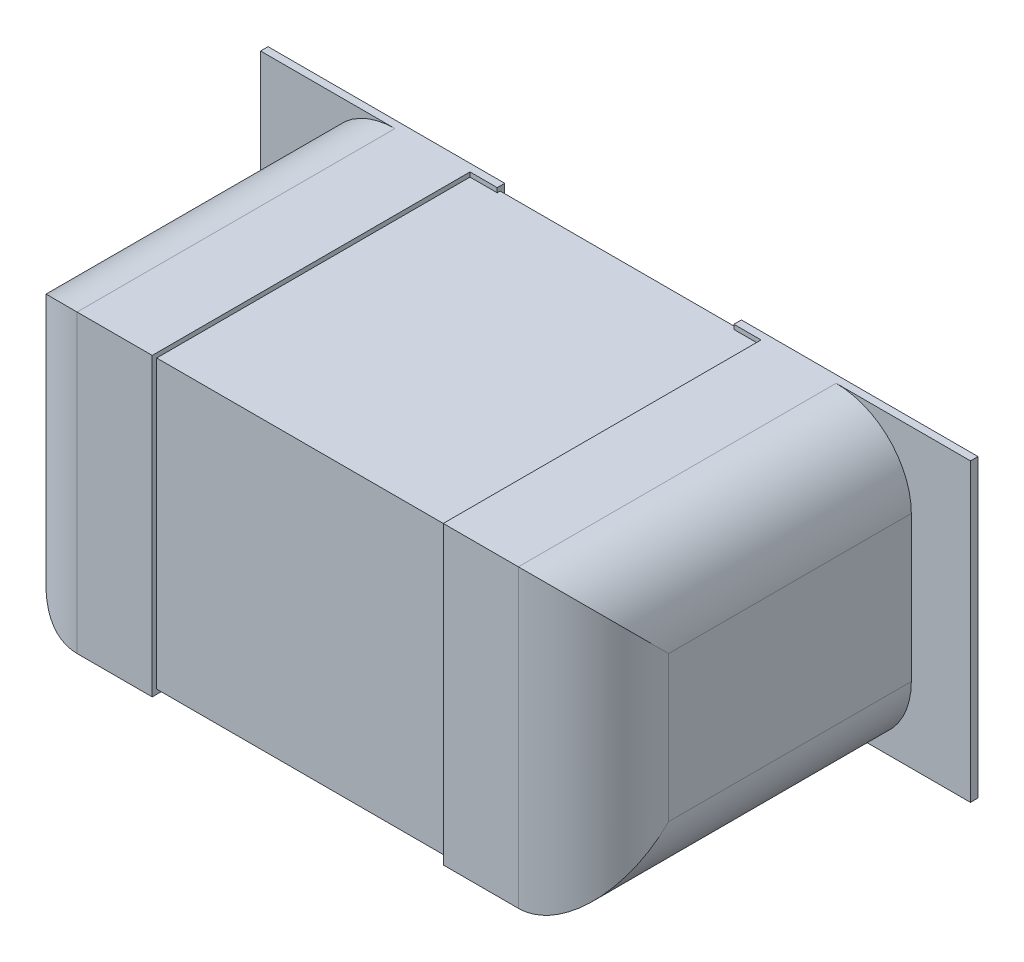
ISO-10303-21;
HEADER;
FILE_DESCRIPTION(('STEP AP214'),'2;1');
FILE_NAME('part.step','',(''),(''),'','','');
FILE_SCHEMA(('AUTOMOTIVE_DESIGN { 1 0 10303 214 1 1 1 1 }'));
ENDSEC;
DATA;
#1=APPLICATION_CONTEXT('core data for automotive mechanical design processes');
#2=APPLICATION_PROTOCOL_DEFINITION('international standard','automotive_design',2000,#1);
#3=PRODUCT_CONTEXT('',#1,'mechanical');
#4=PRODUCT('Part','Part','',(#3));
#5=PRODUCT_RELATED_PRODUCT_CATEGORY('part','',(#4));
#6=PRODUCT_DEFINITION_FORMATION('','',#4);
#7=PRODUCT_DEFINITION_CONTEXT('part definition',#1,'design');
#8=PRODUCT_DEFINITION('design','',#6,#7);
#9=PRODUCT_DEFINITION_SHAPE('','',#8);
#10=(LENGTH_UNIT() NAMED_UNIT(*) SI_UNIT(.MILLI.,.METRE.));
#11=(NAMED_UNIT(*) PLANE_ANGLE_UNIT() SI_UNIT($,.RADIAN.));
#12=(NAMED_UNIT(*) SI_UNIT($,.STERADIAN.) SOLID_ANGLE_UNIT());
#13=UNCERTAINTY_MEASURE_WITH_UNIT(LENGTH_MEASURE(1.E-05),#10,'distance_accuracy_value','');
#14=(GEOMETRIC_REPRESENTATION_CONTEXT(3) GLOBAL_UNCERTAINTY_ASSIGNED_CONTEXT((#13)) GLOBAL_UNIT_ASSIGNED_CONTEXT((#10,
#11,#12)) REPRESENTATION_CONTEXT('',''));
#15=CARTESIAN_POINT('',(0.,0.,0.));
#16=DIRECTION('',(0.,0.,1.));
#17=DIRECTION('',(1.,0.,0.));
#18=AXIS2_PLACEMENT_3D('',#15,#16,#17);
#19=CARTESIAN_POINT('',(0.500000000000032,-0.249999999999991,0.0762));
#20=DIRECTION('',(1.,0.,0.));
#21=DIRECTION('',(0.,0.,-1.));
#22=AXIS2_PLACEMENT_3D('',#19,#20,#21);
#23=PLANE('',#22);
#24=DIRECTION('',(0.,0.,-1.));
#25=VECTOR('',#24,1.);
#26=CARTESIAN_POINT('',(0.500000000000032,-0.122999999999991,0.62831867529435));
#27=LINE('',#26,#25);
#28=CARTESIAN_POINT('',(0.500000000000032,-0.122999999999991,0.0889));
#29=VERTEX_POINT('',#28);
#30=CARTESIAN_POINT('',(0.500000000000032,-0.122999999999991,0.49911));
#31=VERTEX_POINT('',#30);
#32=EDGE_CURVE('E324',#29,#31,#27,.F.);
#33=ORIENTED_EDGE('',*,*,#32,.F.);
#34=DIRECTION('',(0.,1.,0.));
#35=VECTOR('',#34,1.);
#36=CARTESIAN_POINT('',(0.500000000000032,0.,0.0889));
#37=LINE('',#36,#35);
#38=CARTESIAN_POINT('',(0.500000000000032,0.122999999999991,0.0889));
#39=VERTEX_POINT('',#38);
#40=EDGE_CURVE('E237',#39,#29,#37,.F.);
#41=ORIENTED_EDGE('',*,*,#40,.F.);
#42=DIRECTION('',(0.,0.,-1.));
#43=VECTOR('',#42,1.);
#44=CARTESIAN_POINT('',(0.500000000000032,0.122999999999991,0.62831867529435));
#45=LINE('',#44,#43);
#46=CARTESIAN_POINT('',(0.500000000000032,0.122999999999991,0.49911));
#47=VERTEX_POINT('',#46);
#48=EDGE_CURVE('E226',#47,#39,#45,.T.);
#49=ORIENTED_EDGE('',*,*,#48,.F.);
#50=DIRECTION('',(0.,1.,0.));
#51=VECTOR('',#50,1.);
#52=CARTESIAN_POINT('',(0.500000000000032,-0.252128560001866,0.49911));
#53=LINE('',#52,#51);
#54=EDGE_CURVE('E223',#31,#47,#53,.T.);
#55=ORIENTED_EDGE('',*,*,#54,.F.);
#56=EDGE_LOOP('',(#33,#41,#49,#55));
#57=FACE_BOUND('',#56,.T.);
#58=ADVANCED_FACE('F16',(#57),#23,.T.);
#59=CARTESIAN_POINT('',(-0.500000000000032,0.249999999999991,0.0762));
#60=DIRECTION('',(-1.,0.,0.));
#61=DIRECTION('',(0.,0.,1.));
#62=AXIS2_PLACEMENT_3D('',#59,#60,#61);
#63=PLANE('',#62);
#64=DIRECTION('',(0.,0.,-1.));
#65=VECTOR('',#64,1.);
#66=CARTESIAN_POINT('',(-0.500000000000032,0.122999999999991,0.62831867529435));
#67=LINE('',#66,#65);
#68=CARTESIAN_POINT('',(-0.500000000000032,0.122999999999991,0.0889));
#69=VERTEX_POINT('',#68);
#70=CARTESIAN_POINT('',(-0.500000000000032,0.122999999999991,0.49911));
#71=VERTEX_POINT('',#70);
#72=EDGE_CURVE('E308',#69,#71,#67,.F.);
#73=ORIENTED_EDGE('',*,*,#72,.F.);
#74=DIRECTION('',(0.,1.,0.));
#75=VECTOR('',#74,1.);
#76=CARTESIAN_POINT('',(-0.500000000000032,0.,0.0889));
#77=LINE('',#76,#75);
#78=CARTESIAN_POINT('',(-0.500000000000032,-0.122999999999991,0.0889));
#79=VERTEX_POINT('',#78);
#80=EDGE_CURVE('E312',#79,#69,#77,.T.);
#81=ORIENTED_EDGE('',*,*,#80,.F.);
#82=DIRECTION('',(0.,0.,-1.));
#83=VECTOR('',#82,1.);
#84=CARTESIAN_POINT('',(-0.500000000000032,-0.122999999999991,0.62831867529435));
#85=LINE('',#84,#83);
#86=CARTESIAN_POINT('',(-0.500000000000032,-0.122999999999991,0.49911));
#87=VERTEX_POINT('',#86);
#88=EDGE_CURVE('E315',#87,#79,#85,.T.);
#89=ORIENTED_EDGE('',*,*,#88,.F.);
#90=DIRECTION('',(0.,-1.,0.));
#91=VECTOR('',#90,1.);
#92=CARTESIAN_POINT('',(-0.500000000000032,0.252170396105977,0.49911));
#93=LINE('',#92,#91);
#94=EDGE_CURVE('E242',#71,#87,#93,.T.);
#95=ORIENTED_EDGE('',*,*,#94,.F.);
#96=EDGE_LOOP('',(#73,#81,#89,#95));
#97=FACE_BOUND('',#96,.T.);
#98=ADVANCED_FACE('F355',(#97),#63,.T.);
#99=CARTESIAN_POINT('',(-0.373000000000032,0.252170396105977,0.49911));
#100=DIRECTION('',(0.,-1.,0.));
#101=DIRECTION('',(0.,0.,-1.));
#102=AXIS2_PLACEMENT_3D('',#99,#100,#101);
#103=CYLINDRICAL_SURFACE('',#102,0.127);
#104=CARTESIAN_POINT('',(-0.373000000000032,-0.122999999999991,0.49911));
#105=DIRECTION('',(0.,-0.707106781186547,-0.707106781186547));
#106=DIRECTION('',(0.,0.707106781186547,-0.707106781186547));
#107=AXIS2_PLACEMENT_3D('',#104,#105,#106);
#108=ELLIPSE('',#107,0.179605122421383,0.127);
#109=CARTESIAN_POINT('',(-0.373000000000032,-0.249999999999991,0.62611));
#110=VERTEX_POINT('',#109);
#111=EDGE_CURVE('E316',#110,#87,#108,.T.);
#112=ORIENTED_EDGE('',*,*,#111,.F.);
#113=DIRECTION('',(0.,1.,0.));
#114=VECTOR('',#113,1.);
#115=CARTESIAN_POINT('',(-0.373000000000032,0.,0.62611));
#116=LINE('',#115,#114);
#117=CARTESIAN_POINT('',(-0.373000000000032,0.249999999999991,0.62611));
#118=VERTEX_POINT('',#117);
#119=EDGE_CURVE('E207',#118,#110,#116,.F.);
#120=ORIENTED_EDGE('',*,*,#119,.F.);
#121=CARTESIAN_POINT('',(-0.373000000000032,0.122999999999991,0.49911));
#122=DIRECTION('',(0.,0.707106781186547,-0.707106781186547));
#123=DIRECTION('',(0.,-0.707106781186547,-0.707106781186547));
#124=AXIS2_PLACEMENT_3D('',#121,#122,#123);
#125=ELLIPSE('',#124,0.179605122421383,0.127);
#126=EDGE_CURVE('E306',#71,#118,#125,.T.);
#127=ORIENTED_EDGE('',*,*,#126,.F.);
#128=ORIENTED_EDGE('',*,*,#94,.T.);
#129=EDGE_LOOP('',(#112,#120,#127,#128));
#130=FACE_BOUND('',#129,.T.);
#131=ADVANCED_FACE('F360',(#130),#103,.T.);
#132=CARTESIAN_POINT('',(0.373000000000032,-0.252128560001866,0.49911));
#133=DIRECTION('',(0.,1.,0.));
#134=DIRECTION('',(0.,0.,1.));
#135=AXIS2_PLACEMENT_3D('',#132,#133,#134);
#136=CYLINDRICAL_SURFACE('',#135,0.127);
#137=CARTESIAN_POINT('',(0.373000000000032,-0.122999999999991,0.49911));
#138=DIRECTION('',(0.,-0.707106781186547,-0.707106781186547));
#139=DIRECTION('',(0.,0.707106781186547,-0.707106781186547));
#140=AXIS2_PLACEMENT_3D('',#137,#138,#139);
#141=ELLIPSE('',#140,0.179605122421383,0.127);
#142=CARTESIAN_POINT('',(0.373000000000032,-0.249999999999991,0.62611));
#143=VERTEX_POINT('',#142);
#144=EDGE_CURVE('E322',#31,#143,#141,.T.);
#145=ORIENTED_EDGE('',*,*,#144,.F.);
#146=ORIENTED_EDGE('',*,*,#54,.T.);
#147=CARTESIAN_POINT('',(0.373000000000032,0.122999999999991,0.49911));
#148=DIRECTION('',(0.,0.707106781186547,-0.707106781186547));
#149=DIRECTION('',(0.,-0.707106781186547,-0.707106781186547));
#150=AXIS2_PLACEMENT_3D('',#147,#148,#149);
#151=ELLIPSE('',#150,0.179605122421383,0.127);
#152=CARTESIAN_POINT('',(0.373000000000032,0.249999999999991,0.62611));
#153=VERTEX_POINT('',#152);
#154=EDGE_CURVE('E19',#153,#47,#151,.T.);
#155=ORIENTED_EDGE('',*,*,#154,.F.);
#156=DIRECTION('',(0.,1.,0.));
#157=VECTOR('',#156,1.);
#158=CARTESIAN_POINT('',(0.373000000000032,0.,0.62611));
#159=LINE('',#158,#157);
#160=EDGE_CURVE('E197',#143,#153,#159,.T.);
#161=ORIENTED_EDGE('',*,*,#160,.F.);
#162=EDGE_LOOP('',(#145,#146,#155,#161));
#163=FACE_BOUND('',#162,.T.);
#164=ADVANCED_FACE('F221',(#163),#136,.T.);
#165=CARTESIAN_POINT('',(0.373000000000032,0.122999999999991,0.62831867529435));
#166=DIRECTION('',(0.,0.,-1.));
#167=DIRECTION('',(-1.,0.,0.));
#168=AXIS2_PLACEMENT_3D('',#165,#166,#167);
#169=CYLINDRICAL_SURFACE('',#168,0.127);
#170=ORIENTED_EDGE('',*,*,#48,.T.);
#171=CARTESIAN_POINT('',(0.373000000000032,0.122999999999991,0.0888999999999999));
#172=DIRECTION('',(0.,0.,-1.));
#173=DIRECTION('',(-1.,0.,0.));
#174=AXIS2_PLACEMENT_3D('',#171,#172,#173);
#175=CIRCLE('',#174,0.127);
#176=CARTESIAN_POINT('',(0.372860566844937,0.249999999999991,0.0889000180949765));
#177=VERTEX_POINT('',#176);
#178=EDGE_CURVE('E229',#177,#39,#175,.T.);
#179=ORIENTED_EDGE('',*,*,#178,.F.);
#180=DIRECTION('',(-0.000259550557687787,0.,-0.999999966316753));
#181=VECTOR('',#180,1.);
#182=CARTESIAN_POINT('',(0.373000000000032,0.249999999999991,0.62611));
#183=LINE('',#182,#181);
#184=EDGE_CURVE('E214',#153,#177,#183,.T.);
#185=ORIENTED_EDGE('',*,*,#184,.F.);
#186=ORIENTED_EDGE('',*,*,#154,.T.);
#187=EDGE_LOOP('',(#170,#179,#185,#186));
#188=FACE_BOUND('',#187,.T.);
#189=ADVANCED_FACE('F227',(#188),#169,.T.);
#190=CARTESIAN_POINT('',(0.5999988,-0.2500122,0.0762));
#191=DIRECTION('',(1.,0.,0.));
#192=DIRECTION('',(0.,0.,-1.));
#193=AXIS2_PLACEMENT_3D('',#190,#191,#192);
#194=PLANE('',#193);
#195=DIRECTION('',(0.,0.,-1.));
#196=VECTOR('',#195,1.);
#197=CARTESIAN_POINT('',(0.5999988,-0.249999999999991,0.0762));
#198=LINE('',#197,#196);
#199=CARTESIAN_POINT('',(0.5999988,-0.249999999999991,0.0762));
#200=VERTEX_POINT('',#199);
#201=CARTESIAN_POINT('',(0.5999988,-0.249999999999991,0.0889));
#202=VERTEX_POINT('',#201);
#203=EDGE_CURVE('E294',#200,#202,#198,.F.);
#204=ORIENTED_EDGE('',*,*,#203,.F.);
#205=DIRECTION('',(0.,1.,0.));
#206=VECTOR('',#205,1.);
#207=CARTESIAN_POINT('',(0.5999988,0.,0.0762));
#208=LINE('',#207,#206);
#209=CARTESIAN_POINT('',(0.5999988,0.249999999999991,0.0762));
#210=VERTEX_POINT('',#209);
#211=EDGE_CURVE('E297',#200,#210,#208,.T.);
#212=ORIENTED_EDGE('',*,*,#211,.T.);
#213=DIRECTION('',(0.,0.,1.));
#214=VECTOR('',#213,1.);
#215=CARTESIAN_POINT('',(0.5999988,0.249999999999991,0.0762));
#216=LINE('',#215,#214);
#217=CARTESIAN_POINT('',(0.5999988,0.249999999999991,0.0889));
#218=VERTEX_POINT('',#217);
#219=EDGE_CURVE('E233',#218,#210,#216,.F.);
#220=ORIENTED_EDGE('',*,*,#219,.F.);
#221=DIRECTION('',(0.,1.,0.));
#222=VECTOR('',#221,1.);
#223=CARTESIAN_POINT('',(0.5999988,0.,0.0889));
#224=LINE('',#223,#222);
#225=EDGE_CURVE('E240',#202,#218,#224,.T.);
#226=ORIENTED_EDGE('',*,*,#225,.F.);
#227=EDGE_LOOP('',(#204,#212,#220,#226));
#228=FACE_BOUND('',#227,.T.);
#229=ADVANCED_FACE('F335',(#228),#194,.T.);
#230=CARTESIAN_POINT('',(0.,0.,0.0889));
#231=DIRECTION('',(0.,0.,1.));
#232=DIRECTION('',(1.,0.,0.));
#233=AXIS2_PLACEMENT_3D('',#230,#231,#232);
#234=PLANE('',#233);
#235=ORIENTED_EDGE('',*,*,#178,.T.);
#236=ORIENTED_EDGE('',*,*,#40,.T.);
#237=CARTESIAN_POINT('',(0.373000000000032,-0.122999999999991,0.0888999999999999));
#238=DIRECTION('',(0.,0.,-1.));
#239=DIRECTION('',(-1.,0.,0.));
#240=AXIS2_PLACEMENT_3D('',#237,#238,#239);
#241=CIRCLE('',#240,0.127);
#242=CARTESIAN_POINT('',(0.372860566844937,-0.249999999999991,0.0889000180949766));
#243=VERTEX_POINT('',#242);
#244=EDGE_CURVE('E319',#243,#29,#241,.F.);
#245=ORIENTED_EDGE('',*,*,#244,.F.);
#246=DIRECTION('',(1.,0.,0.));
#247=VECTOR('',#246,1.);
#248=CARTESIAN_POINT('',(-0.500000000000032,-0.249999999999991,0.0889));
#249=LINE('',#248,#247);
#250=EDGE_CURVE('E296',#202,#243,#249,.F.);
#251=ORIENTED_EDGE('',*,*,#250,.F.);
#252=ORIENTED_EDGE('',*,*,#225,.T.);
#253=DIRECTION('',(1.,0.,0.));
#254=VECTOR('',#253,1.);
#255=CARTESIAN_POINT('',(0.500000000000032,0.249999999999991,0.0889));
#256=LINE('',#255,#254);
#257=EDGE_CURVE('E231',#177,#218,#256,.T.);
#258=ORIENTED_EDGE('',*,*,#257,.F.);
#259=EDGE_LOOP('',(#235,#236,#245,#251,#252,#258));
#260=FACE_BOUND('',#259,.T.);
#261=ADVANCED_FACE('F328',(#260),#234,.T.);
#262=CARTESIAN_POINT('',(0.373000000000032,-0.122999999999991,0.62831867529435));
#263=DIRECTION('',(0.,0.,-1.));
#264=DIRECTION('',(-1.,0.,0.));
#265=AXIS2_PLACEMENT_3D('',#262,#263,#264);
#266=CYLINDRICAL_SURFACE('',#265,0.127);
#267=DIRECTION('',(0.000259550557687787,0.,0.999999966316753));
#268=VECTOR('',#267,1.);
#269=CARTESIAN_POINT('',(0.37286056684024,-0.249999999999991,0.0889));
#270=LINE('',#269,#268);
#271=EDGE_CURVE('E342',#243,#143,#270,.T.);
#272=ORIENTED_EDGE('',*,*,#271,.F.);
#273=ORIENTED_EDGE('',*,*,#244,.T.);
#274=ORIENTED_EDGE('',*,*,#32,.T.);
#275=ORIENTED_EDGE('',*,*,#144,.T.);
#276=EDGE_LOOP('',(#272,#273,#274,#275));
#277=FACE_BOUND('',#276,.T.);
#278=ADVANCED_FACE('F352',(#277),#266,.T.);
#279=CARTESIAN_POINT('',(-0.373000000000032,-0.122999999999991,0.62831867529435));
#280=DIRECTION('',(0.,0.,-1.));
#281=DIRECTION('',(-1.,0.,0.));
#282=AXIS2_PLACEMENT_3D('',#279,#280,#281);
#283=CYLINDRICAL_SURFACE('',#282,0.127);
#284=ORIENTED_EDGE('',*,*,#88,.T.);
#285=CARTESIAN_POINT('',(-0.373000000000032,-0.122999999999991,0.0888999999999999));
#286=DIRECTION('',(0.,0.,-1.));
#287=DIRECTION('',(-1.,0.,0.));
#288=AXIS2_PLACEMENT_3D('',#285,#286,#287);
#289=CIRCLE('',#288,0.127);
#290=CARTESIAN_POINT('',(-0.372860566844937,-0.249999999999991,0.0889000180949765));
#291=VERTEX_POINT('',#290);
#292=EDGE_CURVE('E309',#291,#79,#289,.T.);
#293=ORIENTED_EDGE('',*,*,#292,.F.);
#294=DIRECTION('',(0.000259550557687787,0.,-0.999999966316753));
#295=VECTOR('',#294,1.);
#296=CARTESIAN_POINT('',(-0.373000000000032,-0.249999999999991,0.62611));
#297=LINE('',#296,#295);
#298=EDGE_CURVE('E289',#110,#291,#297,.T.);
#299=ORIENTED_EDGE('',*,*,#298,.F.);
#300=ORIENTED_EDGE('',*,*,#111,.T.);
#301=EDGE_LOOP('',(#284,#293,#299,#300));
#302=FACE_BOUND('',#301,.T.);
#303=ADVANCED_FACE('F449',(#302),#283,.T.);
#304=CARTESIAN_POINT('',(-0.5999988,0.2500122,0.0762));
#305=DIRECTION('',(-1.,0.,0.));
#306=DIRECTION('',(0.,0.,1.));
#307=AXIS2_PLACEMENT_3D('',#304,#305,#306);
#308=PLANE('',#307);
#309=DIRECTION('',(0.,0.,1.));
#310=VECTOR('',#309,1.);
#311=CARTESIAN_POINT('',(-0.5999988,0.249999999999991,0.0762));
#312=LINE('',#311,#310);
#313=CARTESIAN_POINT('',(-0.5999988,0.249999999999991,0.0762));
#314=VERTEX_POINT('',#313);
#315=CARTESIAN_POINT('',(-0.5999988,0.249999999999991,0.0889));
#316=VERTEX_POINT('',#315);
#317=EDGE_CURVE('E277',#314,#316,#312,.T.);
#318=ORIENTED_EDGE('',*,*,#317,.F.);
#319=DIRECTION('',(0.,1.,0.));
#320=VECTOR('',#319,1.);
#321=CARTESIAN_POINT('',(-0.5999988,0.,0.0762));
#322=LINE('',#321,#320);
#323=CARTESIAN_POINT('',(-0.5999988,-0.249999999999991,0.0762));
#324=VERTEX_POINT('',#323);
#325=EDGE_CURVE('E280',#314,#324,#322,.F.);
#326=ORIENTED_EDGE('',*,*,#325,.T.);
#327=DIRECTION('',(0.,0.,-1.));
#328=VECTOR('',#327,1.);
#329=CARTESIAN_POINT('',(-0.5999988,-0.249999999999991,0.0762));
#330=LINE('',#329,#328);
#331=CARTESIAN_POINT('',(-0.5999988,-0.249999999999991,0.0889));
#332=VERTEX_POINT('',#331);
#333=EDGE_CURVE('E284',#332,#324,#330,.T.);
#334=ORIENTED_EDGE('',*,*,#333,.F.);
#335=DIRECTION('',(0.,1.,0.));
#336=VECTOR('',#335,1.);
#337=CARTESIAN_POINT('',(-0.5999988,0.,0.0889));
#338=LINE('',#337,#336);
#339=EDGE_CURVE('E313',#316,#332,#338,.F.);
#340=ORIENTED_EDGE('',*,*,#339,.F.);
#341=EDGE_LOOP('',(#318,#326,#334,#340));
#342=FACE_BOUND('',#341,.T.);
#343=ADVANCED_FACE('F445',(#342),#308,.T.);
#344=CARTESIAN_POINT('',(0.,0.,0.0889));
#345=DIRECTION('',(0.,0.,1.));
#346=DIRECTION('',(1.,0.,0.));
#347=AXIS2_PLACEMENT_3D('',#344,#345,#346);
#348=PLANE('',#347);
#349=ORIENTED_EDGE('',*,*,#292,.T.);
#350=ORIENTED_EDGE('',*,*,#80,.T.);
#351=CARTESIAN_POINT('',(-0.373000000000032,0.122999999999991,0.0888999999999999));
#352=DIRECTION('',(0.,0.,-1.));
#353=DIRECTION('',(-1.,0.,0.));
#354=AXIS2_PLACEMENT_3D('',#351,#352,#353);
#355=CIRCLE('',#354,0.127);
#356=CARTESIAN_POINT('',(-0.372860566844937,0.249999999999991,0.0889000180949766));
#357=VERTEX_POINT('',#356);
#358=EDGE_CURVE('E303',#357,#69,#355,.F.);
#359=ORIENTED_EDGE('',*,*,#358,.F.);
#360=DIRECTION('',(1.,0.,0.));
#361=VECTOR('',#360,1.);
#362=CARTESIAN_POINT('',(0.500000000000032,0.249999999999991,0.0889));
#363=LINE('',#362,#361);
#364=EDGE_CURVE('E279',#316,#357,#363,.T.);
#365=ORIENTED_EDGE('',*,*,#364,.F.);
#366=ORIENTED_EDGE('',*,*,#339,.T.);
#367=DIRECTION('',(1.,0.,0.));
#368=VECTOR('',#367,1.);
#369=CARTESIAN_POINT('',(-0.500000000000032,-0.249999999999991,0.0889));
#370=LINE('',#369,#368);
#371=EDGE_CURVE('E286',#291,#332,#370,.F.);
#372=ORIENTED_EDGE('',*,*,#371,.F.);
#373=EDGE_LOOP('',(#349,#350,#359,#365,#366,#372));
#374=FACE_BOUND('',#373,.T.);
#375=ADVANCED_FACE('F441',(#374),#348,.T.);
#376=CARTESIAN_POINT('',(-0.373000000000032,0.122999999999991,0.62831867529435));
#377=DIRECTION('',(0.,0.,-1.));
#378=DIRECTION('',(-1.,0.,0.));
#379=AXIS2_PLACEMENT_3D('',#376,#377,#378);
#380=CYLINDRICAL_SURFACE('',#379,0.127);
#381=DIRECTION('',(-0.000259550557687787,0.,0.999999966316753));
#382=VECTOR('',#381,1.);
#383=CARTESIAN_POINT('',(-0.37286056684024,0.249999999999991,0.0889));
#384=LINE('',#383,#382);
#385=EDGE_CURVE('E482',#357,#118,#384,.T.);
#386=ORIENTED_EDGE('',*,*,#385,.F.);
#387=ORIENTED_EDGE('',*,*,#358,.T.);
#388=ORIENTED_EDGE('',*,*,#72,.T.);
#389=ORIENTED_EDGE('',*,*,#126,.T.);
#390=EDGE_LOOP('',(#386,#387,#388,#389));
#391=FACE_BOUND('',#390,.T.);
#392=ADVANCED_FACE('F437',(#391),#380,.T.);
#393=CARTESIAN_POINT('',(0.,0.,0.62611));
#394=DIRECTION('',(0.,0.,1.));
#395=DIRECTION('',(1.,0.,0.));
#396=AXIS2_PLACEMENT_3D('',#393,#394,#395);
#397=PLANE('',#396);
#398=DIRECTION('',(1.,0.,0.));
#399=VECTOR('',#398,1.);
#400=CARTESIAN_POINT('',(0.500000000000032,0.249999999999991,0.62611));
#401=LINE('',#400,#399);
#402=CARTESIAN_POINT('',(-0.246000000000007,0.249999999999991,0.62611));
#403=VERTEX_POINT('',#402);
#404=EDGE_CURVE('E276',#118,#403,#401,.T.);
#405=ORIENTED_EDGE('',*,*,#404,.F.);
#406=ORIENTED_EDGE('',*,*,#119,.T.);
#407=DIRECTION('',(1.,0.,0.));
#408=VECTOR('',#407,1.);
#409=CARTESIAN_POINT('',(-0.500000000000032,-0.249999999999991,0.62611));
#410=LINE('',#409,#408);
#411=CARTESIAN_POINT('',(-0.246000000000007,-0.250002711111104,0.62611));
#412=VERTEX_POINT('',#411);
#413=EDGE_CURVE('E293',#412,#110,#410,.F.);
#414=ORIENTED_EDGE('',*,*,#413,.F.);
#415=DIRECTION('',(0.,1.,0.));
#416=VECTOR('',#415,1.);
#417=CARTESIAN_POINT('',(-0.246000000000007,-0.249999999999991,0.62611));
#418=LINE('',#417,#416);
#419=EDGE_CURVE('E513',#412,#403,#418,.T.);
#420=ORIENTED_EDGE('',*,*,#419,.T.);
#421=EDGE_LOOP('',(#405,#406,#414,#420));
#422=FACE_BOUND('',#421,.T.);
#423=ADVANCED_FACE('F434',(#422),#397,.T.);
#424=CARTESIAN_POINT('',(0.,0.,0.62611));
#425=DIRECTION('',(0.,0.,1.));
#426=DIRECTION('',(1.,0.,0.));
#427=AXIS2_PLACEMENT_3D('',#424,#425,#426);
#428=PLANE('',#427);
#429=DIRECTION('',(1.,0.,0.));
#430=VECTOR('',#429,1.);
#431=CARTESIAN_POINT('',(-0.500000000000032,-0.249999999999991,0.62611));
#432=LINE('',#431,#430);
#433=CARTESIAN_POINT('',(0.246000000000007,-0.249999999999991,0.62611));
#434=VERTEX_POINT('',#433);
#435=EDGE_CURVE('E203',#143,#434,#432,.F.);
#436=ORIENTED_EDGE('',*,*,#435,.F.);
#437=ORIENTED_EDGE('',*,*,#160,.T.);
#438=DIRECTION('',(1.,0.,0.));
#439=VECTOR('',#438,1.);
#440=CARTESIAN_POINT('',(0.500000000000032,0.249999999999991,0.62611));
#441=LINE('',#440,#439);
#442=CARTESIAN_POINT('',(0.246000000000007,0.250002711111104,0.62611));
#443=VERTEX_POINT('',#442);
#444=EDGE_CURVE('E201',#443,#153,#441,.T.);
#445=ORIENTED_EDGE('',*,*,#444,.F.);
#446=DIRECTION('',(0.,1.,0.));
#447=VECTOR('',#446,1.);
#448=CARTESIAN_POINT('',(0.246000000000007,-0.249999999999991,0.62611));
#449=LINE('',#448,#447);
#450=EDGE_CURVE('E568',#443,#434,#449,.F.);
#451=ORIENTED_EDGE('',*,*,#450,.T.);
#452=EDGE_LOOP('',(#436,#437,#445,#451));
#453=FACE_BOUND('',#452,.T.);
#454=ADVANCED_FACE('F199',(#453),#428,.T.);
#455=CARTESIAN_POINT('',(0.,0.,0.0889));
#456=DIRECTION('',(0.,0.,1.));
#457=DIRECTION('',(1.,0.,0.));
#458=AXIS2_PLACEMENT_3D('',#455,#456,#457);
#459=PLANE('',#458);
#460=DIRECTION('',(1.,0.,0.));
#461=VECTOR('',#460,1.);
#462=CARTESIAN_POINT('',(-0.246000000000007,0.242379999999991,0.0889));
#463=LINE('',#462,#461);
#464=CARTESIAN_POINT('',(0.1999996,0.242379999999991,0.0889));
#465=VERTEX_POINT('',#464);
#466=CARTESIAN_POINT('',(0.246000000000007,0.242379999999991,0.0889));
#467=VERTEX_POINT('',#466);
#468=EDGE_CURVE('E529',#465,#467,#463,.T.);
#469=ORIENTED_EDGE('',*,*,#468,.T.);
#470=DIRECTION('',(0.,1.,0.));
#471=VECTOR('',#470,1.);
#472=CARTESIAN_POINT('',(0.246000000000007,-0.249999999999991,0.0889));
#473=LINE('',#472,#471);
#474=CARTESIAN_POINT('',(0.246000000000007,0.250002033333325,0.0889));
#475=VERTEX_POINT('',#474);
#476=EDGE_CURVE('E558',#467,#475,#473,.T.);
#477=ORIENTED_EDGE('',*,*,#476,.T.);
#478=DIRECTION('',(1.,0.,0.));
#479=VECTOR('',#478,1.);
#480=CARTESIAN_POINT('',(0.500000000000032,0.249999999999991,0.0889));
#481=LINE('',#480,#479);
#482=CARTESIAN_POINT('',(0.1999996,0.249999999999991,0.0889));
#483=VERTEX_POINT('',#482);
#484=EDGE_CURVE('E301',#483,#475,#481,.T.);
#485=ORIENTED_EDGE('',*,*,#484,.F.);
#486=DIRECTION('',(0.,1.,0.));
#487=VECTOR('',#486,1.);
#488=CARTESIAN_POINT('',(0.1999996,0.2500122,0.0889));
#489=LINE('',#488,#487);
#490=EDGE_CURVE('E257',#465,#483,#489,.T.);
#491=ORIENTED_EDGE('',*,*,#490,.F.);
#492=EDGE_LOOP('',(#469,#477,#485,#491));
#493=FACE_BOUND('',#492,.T.);
#494=ADVANCED_FACE('F428',(#493),#459,.T.);
#495=CARTESIAN_POINT('',(0.500000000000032,0.249999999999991,0.0762));
#496=DIRECTION('',(0.,1.,0.));
#497=DIRECTION('',(0.,0.,1.));
#498=AXIS2_PLACEMENT_3D('',#495,#496,#497);
#499=PLANE('',#498);
#500=ORIENTED_EDGE('',*,*,#484,.T.);
#501=DIRECTION('',(0.,0.,-1.));
#502=VECTOR('',#501,1.);
#503=CARTESIAN_POINT('',(0.246000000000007,0.25000406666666,0.08382));
#504=LINE('',#503,#502);
#505=EDGE_CURVE('E217',#475,#443,#504,.F.);
#506=ORIENTED_EDGE('',*,*,#505,.T.);
#507=ORIENTED_EDGE('',*,*,#444,.T.);
#508=ORIENTED_EDGE('',*,*,#184,.T.);
#509=ORIENTED_EDGE('',*,*,#257,.T.);
#510=ORIENTED_EDGE('',*,*,#219,.T.);
#511=DIRECTION('',(1.,0.,0.));
#512=VECTOR('',#511,1.);
#513=CARTESIAN_POINT('',(0.500000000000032,0.249999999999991,0.0762));
#514=LINE('',#513,#512);
#515=CARTESIAN_POINT('',(0.1999996,0.249999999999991,0.0762));
#516=VERTEX_POINT('',#515);
#517=EDGE_CURVE('E298',#210,#516,#514,.F.);
#518=ORIENTED_EDGE('',*,*,#517,.T.);
#519=DIRECTION('',(0.,0.,-1.));
#520=VECTOR('',#519,1.);
#521=CARTESIAN_POINT('',(0.1999996,0.249999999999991,0.0762));
#522=LINE('',#521,#520);
#523=EDGE_CURVE('E255',#483,#516,#522,.T.);
#524=ORIENTED_EDGE('',*,*,#523,.F.);
#525=EDGE_LOOP('',(#500,#506,#507,#508,#509,#510,#518,#524));
#526=FACE_BOUND('',#525,.T.);
#527=ADVANCED_FACE('F211',(#526),#499,.T.);
#528=CARTESIAN_POINT('',(0.,0.,0.0762));
#529=DIRECTION('',(0.,0.,1.));
#530=DIRECTION('',(1.,0.,0.));
#531=AXIS2_PLACEMENT_3D('',#528,#529,#530);
#532=PLANE('',#531);
#533=DIRECTION('',(1.,0.,0.));
#534=VECTOR('',#533,1.);
#535=CARTESIAN_POINT('',(-0.500000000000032,-0.249999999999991,0.0762));
#536=LINE('',#535,#534);
#537=CARTESIAN_POINT('',(0.1999996,-0.249999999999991,0.0762));
#538=VERTEX_POINT('',#537);
#539=EDGE_CURVE('E290',#538,#200,#536,.T.);
#540=ORIENTED_EDGE('',*,*,#539,.F.);
#541=DIRECTION('',(0.,1.,0.));
#542=VECTOR('',#541,1.);
#543=CARTESIAN_POINT('',(0.1999996,0.2500122,0.0762));
#544=LINE('',#543,#542);
#545=EDGE_CURVE('E254',#516,#538,#544,.F.);
#546=ORIENTED_EDGE('',*,*,#545,.F.);
#547=ORIENTED_EDGE('',*,*,#517,.F.);
#548=ORIENTED_EDGE('',*,*,#211,.F.);
#549=EDGE_LOOP('',(#540,#546,#547,#548));
#550=FACE_BOUND('',#549,.T.);
#551=ADVANCED_FACE('F423',(#550),#532,.F.);
#552=CARTESIAN_POINT('',(-0.500000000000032,-0.249999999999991,0.0762));
#553=DIRECTION('',(0.,-1.,0.));
#554=DIRECTION('',(0.,0.,-1.));
#555=AXIS2_PLACEMENT_3D('',#552,#553,#554);
#556=PLANE('',#555);
#557=DIRECTION('',(0.,0.,1.));
#558=VECTOR('',#557,1.);
#559=CARTESIAN_POINT('',(0.1999996,-0.249999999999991,0.0762));
#560=LINE('',#559,#558);
#561=CARTESIAN_POINT('',(0.1999996,-0.249999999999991,0.0889));
#562=VERTEX_POINT('',#561);
#563=EDGE_CURVE('E251',#538,#562,#560,.T.);
#564=ORIENTED_EDGE('',*,*,#563,.F.);
#565=ORIENTED_EDGE('',*,*,#539,.T.);
#566=ORIENTED_EDGE('',*,*,#203,.T.);
#567=ORIENTED_EDGE('',*,*,#250,.T.);
#568=ORIENTED_EDGE('',*,*,#271,.T.);
#569=ORIENTED_EDGE('',*,*,#435,.T.);
#570=DIRECTION('',(0.,0.,-1.));
#571=VECTOR('',#570,1.);
#572=CARTESIAN_POINT('',(0.246000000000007,-0.249999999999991,0.08382));
#573=LINE('',#572,#571);
#574=CARTESIAN_POINT('',(0.246000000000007,-0.249999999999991,0.0889));
#575=VERTEX_POINT('',#574);
#576=EDGE_CURVE('E264',#434,#575,#573,.T.);
#577=ORIENTED_EDGE('',*,*,#576,.T.);
#578=DIRECTION('',(1.,0.,0.));
#579=VECTOR('',#578,1.);
#580=CARTESIAN_POINT('',(0.,-0.249999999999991,0.0889));
#581=LINE('',#580,#579);
#582=EDGE_CURVE('E258',#562,#575,#581,.T.);
#583=ORIENTED_EDGE('',*,*,#582,.F.);
#584=EDGE_LOOP('',(#564,#565,#566,#567,#568,#569,#577,#583));
#585=FACE_BOUND('',#584,.T.);
#586=ADVANCED_FACE('F347',(#585),#556,.T.);
#587=CARTESIAN_POINT('',(-0.500000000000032,-0.249999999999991,0.0762));
#588=DIRECTION('',(0.,-1.,0.));
#589=DIRECTION('',(0.,0.,-1.));
#590=AXIS2_PLACEMENT_3D('',#587,#588,#589);
#591=PLANE('',#590);
#592=DIRECTION('',(1.,0.,0.));
#593=VECTOR('',#592,1.);
#594=CARTESIAN_POINT('',(0.,-0.25000406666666,0.0889));
#595=LINE('',#594,#593);
#596=CARTESIAN_POINT('',(-0.246000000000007,-0.250003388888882,0.0889));
#597=VERTEX_POINT('',#596);
#598=CARTESIAN_POINT('',(-0.1999996,-0.250002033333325,0.0889));
#599=VERTEX_POINT('',#598);
#600=EDGE_CURVE('E506',#597,#599,#595,.T.);
#601=ORIENTED_EDGE('',*,*,#600,.F.);
#602=DIRECTION('',(0.,0.,1.));
#603=VECTOR('',#602,1.);
#604=CARTESIAN_POINT('',(-0.246000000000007,-0.25000406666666,0.0762));
#605=LINE('',#604,#603);
#606=EDGE_CURVE('E505',#597,#412,#605,.T.);
#607=ORIENTED_EDGE('',*,*,#606,.T.);
#608=ORIENTED_EDGE('',*,*,#413,.T.);
#609=ORIENTED_EDGE('',*,*,#298,.T.);
#610=ORIENTED_EDGE('',*,*,#371,.T.);
#611=ORIENTED_EDGE('',*,*,#333,.T.);
#612=DIRECTION('',(1.,0.,0.));
#613=VECTOR('',#612,1.);
#614=CARTESIAN_POINT('',(-0.500000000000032,-0.249999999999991,0.0762));
#615=LINE('',#614,#613);
#616=CARTESIAN_POINT('',(-0.1999996,-0.249999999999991,0.0762));
#617=VERTEX_POINT('',#616);
#618=EDGE_CURVE('E281',#324,#617,#615,.T.);
#619=ORIENTED_EDGE('',*,*,#618,.T.);
#620=DIRECTION('',(0.,0.,-1.));
#621=VECTOR('',#620,1.);
#622=CARTESIAN_POINT('',(-0.1999996,-0.249999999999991,0.0762));
#623=LINE('',#622,#621);
#624=EDGE_CURVE('E248',#599,#617,#623,.T.);
#625=ORIENTED_EDGE('',*,*,#624,.F.);
#626=EDGE_LOOP('',(#601,#607,#608,#609,#610,#611,#619,#625));
#627=FACE_BOUND('',#626,.T.);
#628=ADVANCED_FACE('F416',(#627),#591,.T.);
#629=CARTESIAN_POINT('',(0.,0.,0.0762));
#630=DIRECTION('',(0.,0.,1.));
#631=DIRECTION('',(1.,0.,0.));
#632=AXIS2_PLACEMENT_3D('',#629,#630,#631);
#633=PLANE('',#632);
#634=DIRECTION('',(1.,0.,0.));
#635=VECTOR('',#634,1.);
#636=CARTESIAN_POINT('',(0.500000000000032,0.249999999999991,0.0762));
#637=LINE('',#636,#635);
#638=CARTESIAN_POINT('',(-0.1999996,0.249999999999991,0.0762));
#639=VERTEX_POINT('',#638);
#640=EDGE_CURVE('E273',#639,#314,#637,.F.);
#641=ORIENTED_EDGE('',*,*,#640,.F.);
#642=DIRECTION('',(0.,1.,0.));
#643=VECTOR('',#642,1.);
#644=CARTESIAN_POINT('',(-0.1999996,-0.2500122,0.0762));
#645=LINE('',#644,#643);
#646=EDGE_CURVE('E247',#617,#639,#645,.T.);
#647=ORIENTED_EDGE('',*,*,#646,.F.);
#648=ORIENTED_EDGE('',*,*,#618,.F.);
#649=ORIENTED_EDGE('',*,*,#325,.F.);
#650=EDGE_LOOP('',(#641,#647,#648,#649));
#651=FACE_BOUND('',#650,.T.);
#652=ADVANCED_FACE('F412',(#651),#633,.F.);
#653=CARTESIAN_POINT('',(0.500000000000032,0.249999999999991,0.0762));
#654=DIRECTION('',(0.,1.,0.));
#655=DIRECTION('',(0.,0.,1.));
#656=AXIS2_PLACEMENT_3D('',#653,#654,#655);
#657=PLANE('',#656);
#658=DIRECTION('',(0.,0.,1.));
#659=VECTOR('',#658,1.);
#660=CARTESIAN_POINT('',(-0.1999996,0.249999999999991,0.0762));
#661=LINE('',#660,#659);
#662=CARTESIAN_POINT('',(-0.1999996,0.249999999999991,0.0889));
#663=VERTEX_POINT('',#662);
#664=EDGE_CURVE('E244',#639,#663,#661,.T.);
#665=ORIENTED_EDGE('',*,*,#664,.F.);
#666=ORIENTED_EDGE('',*,*,#640,.T.);
#667=ORIENTED_EDGE('',*,*,#317,.T.);
#668=ORIENTED_EDGE('',*,*,#364,.T.);
#669=ORIENTED_EDGE('',*,*,#385,.T.);
#670=ORIENTED_EDGE('',*,*,#404,.T.);
#671=DIRECTION('',(0.,0.,1.));
#672=VECTOR('',#671,1.);
#673=CARTESIAN_POINT('',(-0.246000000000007,0.249999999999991,0.0762));
#674=LINE('',#673,#672);
#675=CARTESIAN_POINT('',(-0.246000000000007,0.249999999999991,0.0889));
#676=VERTEX_POINT('',#675);
#677=EDGE_CURVE('E269',#403,#676,#674,.F.);
#678=ORIENTED_EDGE('',*,*,#677,.T.);
#679=DIRECTION('',(-1.,0.,0.));
#680=VECTOR('',#679,1.);
#681=CARTESIAN_POINT('',(0.,0.249999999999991,0.0889));
#682=LINE('',#681,#680);
#683=EDGE_CURVE('E270',#663,#676,#682,.T.);
#684=ORIENTED_EDGE('',*,*,#683,.F.);
#685=EDGE_LOOP('',(#665,#666,#667,#668,#669,#670,#678,#684));
#686=FACE_BOUND('',#685,.T.);
#687=ADVANCED_FACE('F408',(#686),#657,.T.);
#688=CARTESIAN_POINT('',(0.,0.,0.0889));
#689=DIRECTION('',(0.,0.,1.));
#690=DIRECTION('',(1.,0.,0.));
#691=AXIS2_PLACEMENT_3D('',#688,#689,#690);
#692=PLANE('',#691);
#693=DIRECTION('',(0.,1.,0.));
#694=VECTOR('',#693,1.);
#695=CARTESIAN_POINT('',(-0.1999996,-0.2500122,0.0889));
#696=LINE('',#695,#694);
#697=CARTESIAN_POINT('',(-0.1999996,0.242379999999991,0.0889));
#698=VERTEX_POINT('',#697);
#699=EDGE_CURVE('E246',#663,#698,#696,.F.);
#700=ORIENTED_EDGE('',*,*,#699,.F.);
#701=ORIENTED_EDGE('',*,*,#683,.T.);
#702=DIRECTION('',(0.,1.,0.));
#703=VECTOR('',#702,1.);
#704=CARTESIAN_POINT('',(-0.246000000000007,0.,0.0889));
#705=LINE('',#704,#703);
#706=CARTESIAN_POINT('',(-0.246000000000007,0.242379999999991,0.0889));
#707=VERTEX_POINT('',#706);
#708=EDGE_CURVE('E265',#676,#707,#705,.F.);
#709=ORIENTED_EDGE('',*,*,#708,.T.);
#710=DIRECTION('',(1.,0.,0.));
#711=VECTOR('',#710,1.);
#712=CARTESIAN_POINT('',(-0.246000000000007,0.242379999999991,0.0889));
#713=LINE('',#712,#711);
#714=EDGE_CURVE('E272',#707,#698,#713,.T.);
#715=ORIENTED_EDGE('',*,*,#714,.T.);
#716=EDGE_LOOP('',(#700,#701,#709,#715));
#717=FACE_BOUND('',#716,.T.);
#718=ADVANCED_FACE('F404',(#717),#692,.T.);
#719=CARTESIAN_POINT('',(-0.246000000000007,0.242379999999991,0.0762));
#720=DIRECTION('',(0.,-1.,0.));
#721=DIRECTION('',(0.,0.,-1.));
#722=AXIS2_PLACEMENT_3D('',#719,#720,#721);
#723=PLANE('',#722);
#724=DIRECTION('',(-1.,0.,0.));
#725=VECTOR('',#724,1.);
#726=CARTESIAN_POINT('',(-0.246000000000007,0.242379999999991,0.61849));
#727=LINE('',#726,#725);
#728=CARTESIAN_POINT('',(-0.246000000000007,0.242379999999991,0.61849));
#729=VERTEX_POINT('',#728);
#730=CARTESIAN_POINT('',(0.246000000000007,0.242379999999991,0.61849));
#731=VERTEX_POINT('',#730);
#732=EDGE_CURVE('E536',#729,#731,#727,.F.);
#733=ORIENTED_EDGE('',*,*,#732,.T.);
#734=DIRECTION('',(0.,0.,-1.));
#735=VECTOR('',#734,1.);
#736=CARTESIAN_POINT('',(0.246000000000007,0.242379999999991,0.08382));
#737=LINE('',#736,#735);
#738=EDGE_CURVE('E553',#731,#467,#737,.T.);
#739=ORIENTED_EDGE('',*,*,#738,.T.);
#740=ORIENTED_EDGE('',*,*,#468,.F.);
#741=DIRECTION('',(0.,0.,1.));
#742=VECTOR('',#741,1.);
#743=CARTESIAN_POINT('',(0.1999996,0.242379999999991,0.0762));
#744=LINE('',#743,#742);
#745=CARTESIAN_POINT('',(0.1999996,0.242379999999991,0.08382));
#746=VERTEX_POINT('',#745);
#747=EDGE_CURVE('E261',#746,#465,#744,.T.);
#748=ORIENTED_EDGE('',*,*,#747,.F.);
#749=DIRECTION('',(1.,0.,0.));
#750=VECTOR('',#749,1.);
#751=CARTESIAN_POINT('',(-0.246000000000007,0.242379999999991,0.08382));
#752=LINE('',#751,#750);
#753=CARTESIAN_POINT('',(-0.1999996,0.242379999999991,0.08382));
#754=VERTEX_POINT('',#753);
#755=EDGE_CURVE('E591',#746,#754,#752,.F.);
#756=ORIENTED_EDGE('',*,*,#755,.T.);
#757=DIRECTION('',(0.,0.,-1.));
#758=VECTOR('',#757,1.);
#759=CARTESIAN_POINT('',(-0.1999996,0.242379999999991,0.0762));
#760=LINE('',#759,#758);
#761=EDGE_CURVE('E491',#698,#754,#760,.T.);
#762=ORIENTED_EDGE('',*,*,#761,.F.);
#763=ORIENTED_EDGE('',*,*,#714,.F.);
#764=DIRECTION('',(0.,0.,1.));
#765=VECTOR('',#764,1.);
#766=CARTESIAN_POINT('',(-0.246000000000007,0.242379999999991,0.0762));
#767=LINE('',#766,#765);
#768=EDGE_CURVE('E268',#707,#729,#767,.T.);
#769=ORIENTED_EDGE('',*,*,#768,.T.);
#770=EDGE_LOOP('',(#733,#739,#740,#748,#756,#762,#763,#769));
#771=FACE_BOUND('',#770,.T.);
#772=ADVANCED_FACE('F400',(#771),#723,.F.);
#773=CARTESIAN_POINT('',(0.,0.,0.0889));
#774=DIRECTION('',(0.,0.,1.));
#775=DIRECTION('',(1.,0.,0.));
#776=AXIS2_PLACEMENT_3D('',#773,#774,#775);
#777=PLANE('',#776);
#778=DIRECTION('',(1.,0.,0.));
#779=VECTOR('',#778,1.);
#780=CARTESIAN_POINT('',(-0.246000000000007,-0.242379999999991,0.0888999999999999));
#781=LINE('',#780,#779);
#782=CARTESIAN_POINT('',(-0.1999996,-0.242379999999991,0.0889));
#783=VERTEX_POINT('',#782);
#784=CARTESIAN_POINT('',(-0.246000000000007,-0.242379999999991,0.0889));
#785=VERTEX_POINT('',#784);
#786=EDGE_CURVE('E499',#783,#785,#781,.F.);
#787=ORIENTED_EDGE('',*,*,#786,.T.);
#788=DIRECTION('',(0.,1.,0.));
#789=VECTOR('',#788,1.);
#790=CARTESIAN_POINT('',(-0.246000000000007,-0.249999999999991,0.0889));
#791=LINE('',#790,#789);
#792=EDGE_CURVE('E502',#785,#597,#791,.F.);
#793=ORIENTED_EDGE('',*,*,#792,.T.);
#794=ORIENTED_EDGE('',*,*,#600,.T.);
#795=DIRECTION('',(0.,1.,0.));
#796=VECTOR('',#795,1.);
#797=CARTESIAN_POINT('',(-0.1999996,-0.2500122,0.0889));
#798=LINE('',#797,#796);
#799=EDGE_CURVE('E250',#783,#599,#798,.F.);
#800=ORIENTED_EDGE('',*,*,#799,.F.);
#801=EDGE_LOOP('',(#787,#793,#794,#800));
#802=FACE_BOUND('',#801,.T.);
#803=ADVANCED_FACE('F396',(#802),#777,.T.);
#804=CARTESIAN_POINT('',(-0.246000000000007,-0.249999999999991,0.0762));
#805=DIRECTION('',(-1.,0.,0.));
#806=DIRECTION('',(0.,0.,1.));
#807=AXIS2_PLACEMENT_3D('',#804,#805,#806);
#808=PLANE('',#807);
#809=DIRECTION('',(0.,1.,0.));
#810=VECTOR('',#809,1.);
#811=CARTESIAN_POINT('',(-0.246000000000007,0.249999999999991,0.61849));
#812=LINE('',#811,#810);
#813=CARTESIAN_POINT('',(-0.246000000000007,-0.242379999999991,0.61849));
#814=VERTEX_POINT('',#813);
#815=EDGE_CURVE('E532',#814,#729,#812,.T.);
#816=ORIENTED_EDGE('',*,*,#815,.T.);
#817=ORIENTED_EDGE('',*,*,#768,.F.);
#818=ORIENTED_EDGE('',*,*,#708,.F.);
#819=ORIENTED_EDGE('',*,*,#677,.F.);
#820=ORIENTED_EDGE('',*,*,#419,.F.);
#821=ORIENTED_EDGE('',*,*,#606,.F.);
#822=ORIENTED_EDGE('',*,*,#792,.F.);
#823=DIRECTION('',(0.,0.,1.));
#824=VECTOR('',#823,1.);
#825=CARTESIAN_POINT('',(-0.246000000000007,-0.242379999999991,0.62611));
#826=LINE('',#825,#824);
#827=EDGE_CURVE('E495',#785,#814,#826,.T.);
#828=ORIENTED_EDGE('',*,*,#827,.T.);
#829=EDGE_LOOP('',(#816,#817,#818,#819,#820,#821,#822,#828));
#830=FACE_BOUND('',#829,.T.);
#831=ADVANCED_FACE('F392',(#830),#808,.F.);
#832=CARTESIAN_POINT('',(-0.246000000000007,0.249999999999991,0.61849));
#833=DIRECTION('',(0.,0.,-1.));
#834=DIRECTION('',(-1.,0.,0.));
#835=AXIS2_PLACEMENT_3D('',#832,#833,#834);
#836=PLANE('',#835);
#837=DIRECTION('',(1.,0.,0.));
#838=VECTOR('',#837,1.);
#839=CARTESIAN_POINT('',(-0.246000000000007,-0.242379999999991,0.61849));
#840=LINE('',#839,#838);
#841=CARTESIAN_POINT('',(0.246000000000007,-0.242379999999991,0.61849));
#842=VERTEX_POINT('',#841);
#843=EDGE_CURVE('E498',#814,#842,#840,.T.);
#844=ORIENTED_EDGE('',*,*,#843,.T.);
#845=DIRECTION('',(0.,1.,0.));
#846=VECTOR('',#845,1.);
#847=CARTESIAN_POINT('',(0.246000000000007,-0.249999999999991,0.61849));
#848=LINE('',#847,#846);
#849=EDGE_CURVE('E535',#842,#731,#848,.T.);
#850=ORIENTED_EDGE('',*,*,#849,.T.);
#851=ORIENTED_EDGE('',*,*,#732,.F.);
#852=ORIENTED_EDGE('',*,*,#815,.F.);
#853=EDGE_LOOP('',(#844,#850,#851,#852));
#854=FACE_BOUND('',#853,.T.);
#855=ADVANCED_FACE('F388',(#854),#836,.F.);
#856=CARTESIAN_POINT('',(0.246000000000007,-0.249999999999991,0.08382));
#857=DIRECTION('',(1.,0.,0.));
#858=DIRECTION('',(0.,0.,-1.));
#859=AXIS2_PLACEMENT_3D('',#856,#857,#858);
#860=PLANE('',#859);
#861=ORIENTED_EDGE('',*,*,#450,.F.);
#862=ORIENTED_EDGE('',*,*,#505,.F.);
#863=ORIENTED_EDGE('',*,*,#476,.F.);
#864=ORIENTED_EDGE('',*,*,#738,.F.);
#865=ORIENTED_EDGE('',*,*,#849,.F.);
#866=DIRECTION('',(0.,0.,1.));
#867=VECTOR('',#866,1.);
#868=CARTESIAN_POINT('',(0.246000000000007,-0.242379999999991,0.62611));
#869=LINE('',#868,#867);
#870=CARTESIAN_POINT('',(0.246000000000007,-0.242379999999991,0.0889));
#871=VERTEX_POINT('',#870);
#872=EDGE_CURVE('E545',#842,#871,#869,.F.);
#873=ORIENTED_EDGE('',*,*,#872,.T.);
#874=DIRECTION('',(0.,1.,0.));
#875=VECTOR('',#874,1.);
#876=CARTESIAN_POINT('',(0.246000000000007,0.,0.0889));
#877=LINE('',#876,#875);
#878=EDGE_CURVE('E262',#575,#871,#877,.T.);
#879=ORIENTED_EDGE('',*,*,#878,.F.);
#880=ORIENTED_EDGE('',*,*,#576,.F.);
#881=EDGE_LOOP('',(#861,#862,#863,#864,#865,#873,#879,#880));
#882=FACE_BOUND('',#881,.T.);
#883=ADVANCED_FACE('F384',(#882),#860,.F.);
#884=CARTESIAN_POINT('',(0.,0.,0.0889));
#885=DIRECTION('',(0.,0.,1.));
#886=DIRECTION('',(1.,0.,0.));
#887=AXIS2_PLACEMENT_3D('',#884,#885,#886);
#888=PLANE('',#887);
#889=DIRECTION('',(0.,1.,0.));
#890=VECTOR('',#889,1.);
#891=CARTESIAN_POINT('',(0.1999996,0.2500122,0.0889));
#892=LINE('',#891,#890);
#893=CARTESIAN_POINT('',(0.1999996,-0.242379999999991,0.0889));
#894=VERTEX_POINT('',#893);
#895=EDGE_CURVE('E253',#562,#894,#892,.T.);
#896=ORIENTED_EDGE('',*,*,#895,.F.);
#897=ORIENTED_EDGE('',*,*,#582,.T.);
#898=ORIENTED_EDGE('',*,*,#878,.T.);
#899=DIRECTION('',(1.,0.,0.));
#900=VECTOR('',#899,1.);
#901=CARTESIAN_POINT('',(-0.246000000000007,-0.242379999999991,0.0888999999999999));
#902=LINE('',#901,#900);
#903=EDGE_CURVE('E582',#871,#894,#902,.F.);
#904=ORIENTED_EDGE('',*,*,#903,.T.);
#905=EDGE_LOOP('',(#896,#897,#898,#904));
#906=FACE_BOUND('',#905,.T.);
#907=ADVANCED_FACE('F380',(#906),#888,.T.);
#908=CARTESIAN_POINT('',(0.1999996,0.2500122,0.0762));
#909=DIRECTION('',(-1.,0.,0.));
#910=DIRECTION('',(0.,0.,1.));
#911=AXIS2_PLACEMENT_3D('',#908,#909,#910);
#912=PLANE('',#911);
#913=DIRECTION('',(0.,0.,1.));
#914=VECTOR('',#913,1.);
#915=CARTESIAN_POINT('',(0.1999996,-0.242379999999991,0.62611));
#916=LINE('',#915,#914);
#917=CARTESIAN_POINT('',(0.1999996,-0.242379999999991,0.08382));
#918=VERTEX_POINT('',#917);
#919=EDGE_CURVE('E585',#894,#918,#916,.F.);
#920=ORIENTED_EDGE('',*,*,#919,.T.);
#921=DIRECTION('',(0.,1.,0.));
#922=VECTOR('',#921,1.);
#923=CARTESIAN_POINT('',(0.1999996,-0.249999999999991,0.08382));
#924=LINE('',#923,#922);
#925=EDGE_CURVE('E588',#918,#746,#924,.T.);
#926=ORIENTED_EDGE('',*,*,#925,.T.);
#927=ORIENTED_EDGE('',*,*,#747,.T.);
#928=ORIENTED_EDGE('',*,*,#490,.T.);
#929=ORIENTED_EDGE('',*,*,#523,.T.);
#930=ORIENTED_EDGE('',*,*,#545,.T.);
#931=ORIENTED_EDGE('',*,*,#563,.T.);
#932=ORIENTED_EDGE('',*,*,#895,.T.);
#933=EDGE_LOOP('',(#920,#926,#927,#928,#929,#930,#931,#932));
#934=FACE_BOUND('',#933,.T.);
#935=ADVANCED_FACE('F376',(#934),#912,.T.);
#936=CARTESIAN_POINT('',(-0.246000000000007,-0.249999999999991,0.08382));
#937=DIRECTION('',(0.,0.,1.));
#938=DIRECTION('',(1.,0.,0.));
#939=AXIS2_PLACEMENT_3D('',#936,#937,#938);
#940=PLANE('',#939);
#941=DIRECTION('',(0.,1.,0.));
#942=VECTOR('',#941,1.);
#943=CARTESIAN_POINT('',(-0.1999996,-0.2500122,0.08382));
#944=LINE('',#943,#942);
#945=CARTESIAN_POINT('',(-0.1999996,-0.242379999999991,0.08382));
#946=VERTEX_POINT('',#945);
#947=EDGE_CURVE('E33',#754,#946,#944,.F.);
#948=ORIENTED_EDGE('',*,*,#947,.F.);
#949=ORIENTED_EDGE('',*,*,#755,.F.);
#950=ORIENTED_EDGE('',*,*,#925,.F.);
#951=DIRECTION('',(1.,0.,0.));
#952=VECTOR('',#951,1.);
#953=CARTESIAN_POINT('',(-0.246000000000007,-0.242379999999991,0.08382));
#954=LINE('',#953,#952);
#955=EDGE_CURVE('E25',#918,#946,#954,.F.);
#956=ORIENTED_EDGE('',*,*,#955,.T.);
#957=EDGE_LOOP('',(#948,#949,#950,#956));
#958=FACE_BOUND('',#957,.T.);
#959=ADVANCED_FACE('F370',(#958),#940,.F.);
#960=CARTESIAN_POINT('',(-0.1999996,-0.2500122,0.0762));
#961=DIRECTION('',(1.,0.,0.));
#962=DIRECTION('',(0.,0.,-1.));
#963=AXIS2_PLACEMENT_3D('',#960,#961,#962);
#964=PLANE('',#963);
#965=ORIENTED_EDGE('',*,*,#761,.T.);
#966=ORIENTED_EDGE('',*,*,#947,.T.);
#967=DIRECTION('',(0.,0.,1.));
#968=VECTOR('',#967,1.);
#969=CARTESIAN_POINT('',(-0.1999996,-0.242379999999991,0.62611));
#970=LINE('',#969,#968);
#971=EDGE_CURVE('E11',#946,#783,#970,.T.);
#972=ORIENTED_EDGE('',*,*,#971,.T.);
#973=ORIENTED_EDGE('',*,*,#799,.T.);
#974=ORIENTED_EDGE('',*,*,#624,.T.);
#975=ORIENTED_EDGE('',*,*,#646,.T.);
#976=ORIENTED_EDGE('',*,*,#664,.T.);
#977=ORIENTED_EDGE('',*,*,#699,.T.);
#978=EDGE_LOOP('',(#965,#966,#972,#973,#974,#975,#976,#977));
#979=FACE_BOUND('',#978,.T.);
#980=ADVANCED_FACE('F364',(#979),#964,.T.);
#981=CARTESIAN_POINT('',(-0.246000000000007,-0.242379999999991,0.62611));
#982=DIRECTION('',(0.,1.,0.));
#983=DIRECTION('',(0.,0.,1.));
#984=AXIS2_PLACEMENT_3D('',#981,#982,#983);
#985=PLANE('',#984);
#986=ORIENTED_EDGE('',*,*,#955,.F.);
#987=ORIENTED_EDGE('',*,*,#919,.F.);
#988=ORIENTED_EDGE('',*,*,#903,.F.);
#989=ORIENTED_EDGE('',*,*,#872,.F.);
#990=ORIENTED_EDGE('',*,*,#843,.F.);
#991=ORIENTED_EDGE('',*,*,#827,.F.);
#992=ORIENTED_EDGE('',*,*,#786,.F.);
#993=ORIENTED_EDGE('',*,*,#971,.F.);
#994=EDGE_LOOP('',(#986,#987,#988,#989,#990,#991,#992,#993));
#995=FACE_BOUND('',#994,.T.);
#996=ADVANCED_FACE('F362',(#995),#985,.F.);
#997=CLOSED_SHELL('',(#58,#98,#131,#164,#189,#229,#261,#278,#303,#343,#375,#392,#423,#454,#494,
#527,#551,#586,#628,#652,#687,#718,#772,#803,#831,#855,#883,#907,#935,#959,#980,#996));
#998=MANIFOLD_SOLID_BREP('B1',#997);
#999=ADVANCED_BREP_SHAPE_REPRESENTATION('',(#18,#998),#14);
#1000=SHAPE_DEFINITION_REPRESENTATION(#9,#999);
ENDSEC;
END-ISO-10303-21;
